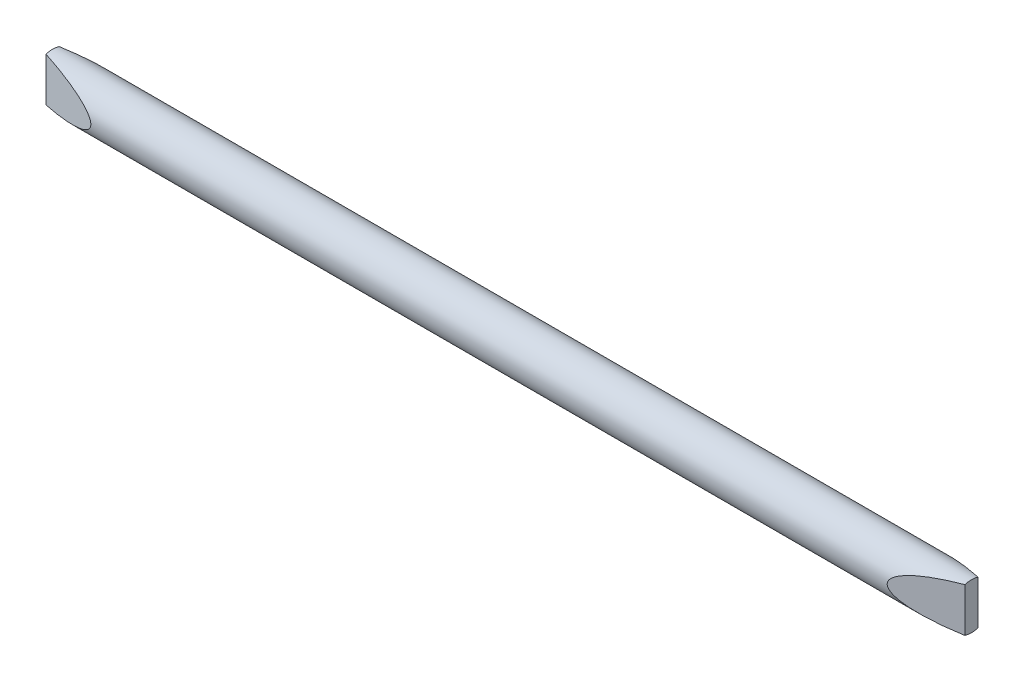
from build123d import *

# Parameters (mm, degrees)
SKETCH1_W          = 120
SKETCH1_H          = 3
CUT_EXTRUDE1_DEPTH = 15


with BuildPart() as part:
    # Sketch1 → Revolve1 (revolve)
    with BuildSketch(Plane.XY, mode=Mode.PRIVATE) as revolve1_sk:
        with Locations((60, 1.5)):
            Rectangle(SKETCH1_W, SKETCH1_H)
    revolve(revolve1_sk.sketch.rotate(Axis((0, 0, 0), (1, 0, 0)), 90), axis=Axis((0, 0, 0), (1, 0, 0)))

    # Sketch3 → Cut-Extrude1 (cut, symmetric)
    with BuildSketch(Plane(origin=(0, 0, 0), x_dir=(1, 0, 0), z_dir=(0, 1, 0))):
        Polygon((120, 0.856406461), (112, 3), (120, 3), align=None)
        Polygon((120, -3), (120, -0.856406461), (112, -3), align=None)
        Polygon((0, -0.856406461), (8, -3), (0, -3), align=None)
        Polygon((0, 3), (0, 0.856406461), (8, 3), align=None)
    extrude(amount=CUT_EXTRUDE1_DEPTH, both=True, mode=Mode.SUBTRACT)


solid = part.part
